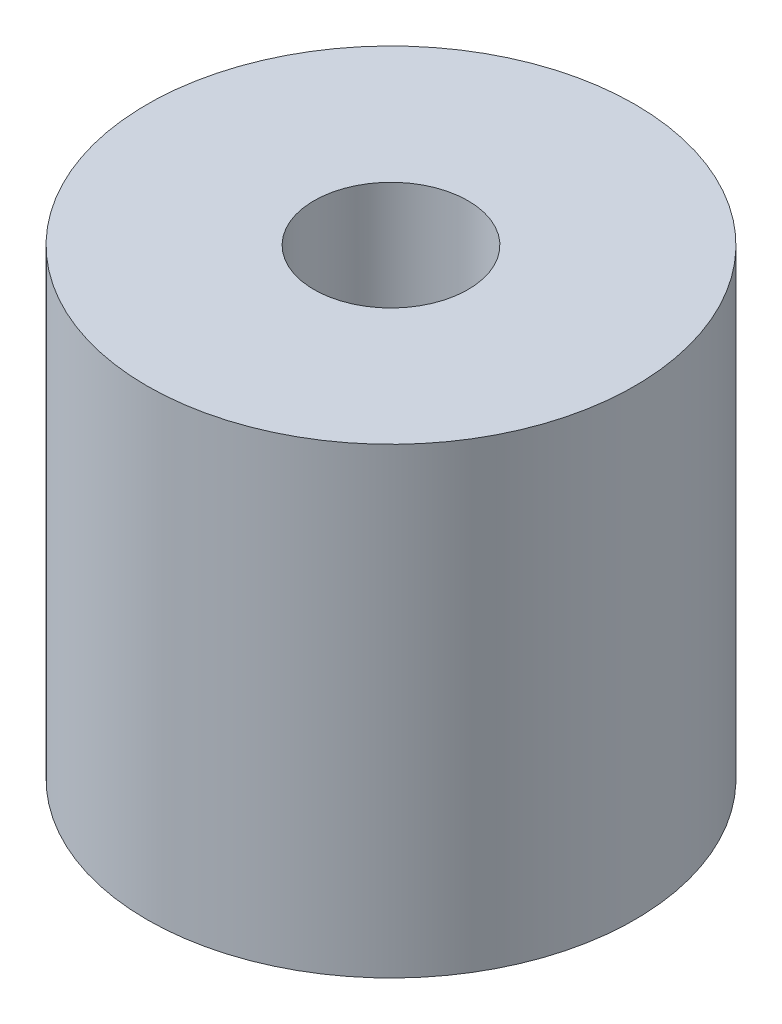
ISO-10303-21;
HEADER;
FILE_DESCRIPTION(('STEP AP214'),'2;1');
FILE_NAME('part.step','',(''),(''),'','','');
FILE_SCHEMA(('AUTOMOTIVE_DESIGN { 1 0 10303 214 1 1 1 1 }'));
ENDSEC;
DATA;
#1=APPLICATION_CONTEXT('core data for automotive mechanical design processes');
#2=APPLICATION_PROTOCOL_DEFINITION('international standard','automotive_design',2000,#1);
#3=PRODUCT_CONTEXT('',#1,'mechanical');
#4=PRODUCT('Part','Part','',(#3));
#5=PRODUCT_RELATED_PRODUCT_CATEGORY('part','',(#4));
#6=PRODUCT_DEFINITION_FORMATION('','',#4);
#7=PRODUCT_DEFINITION_CONTEXT('part definition',#1,'design');
#8=PRODUCT_DEFINITION('design','',#6,#7);
#9=PRODUCT_DEFINITION_SHAPE('','',#8);
#10=(LENGTH_UNIT() NAMED_UNIT(*) SI_UNIT(.MILLI.,.METRE.));
#11=(NAMED_UNIT(*) PLANE_ANGLE_UNIT() SI_UNIT($,.RADIAN.));
#12=(NAMED_UNIT(*) SI_UNIT($,.STERADIAN.) SOLID_ANGLE_UNIT());
#13=UNCERTAINTY_MEASURE_WITH_UNIT(LENGTH_MEASURE(1.E-05),#10,'distance_accuracy_value','');
#14=(GEOMETRIC_REPRESENTATION_CONTEXT(3) GLOBAL_UNCERTAINTY_ASSIGNED_CONTEXT((#13)) GLOBAL_UNIT_ASSIGNED_CONTEXT((#10,
#11,#12)) REPRESENTATION_CONTEXT('',''));
#15=CARTESIAN_POINT('',(0.,0.,0.));
#16=DIRECTION('',(0.,0.,1.));
#17=DIRECTION('',(1.,0.,0.));
#18=AXIS2_PLACEMENT_3D('',#15,#16,#17);
#19=CARTESIAN_POINT('',(0.,18.,0.));
#20=DIRECTION('',(0.,-1.,0.));
#21=DIRECTION('',(0.,0.,-1.));
#22=AXIS2_PLACEMENT_3D('',#19,#20,#21);
#23=CYLINDRICAL_SURFACE('',#22,9.5);
#24=CARTESIAN_POINT('',(0.,18.,0.));
#25=DIRECTION('',(0.,1.,0.));
#26=DIRECTION('',(0.,0.,1.));
#27=AXIS2_PLACEMENT_3D('',#24,#25,#26);
#28=CIRCLE('',#27,9.5);
#29=CARTESIAN_POINT('',(0.,18.,9.5));
#30=VERTEX_POINT('',#29);
#31=EDGE_CURVE('E10',#30,#30,#28,.T.);
#32=ORIENTED_EDGE('',*,*,#31,.F.);
#33=EDGE_LOOP('',(#32));
#34=FACE_BOUND('',#33,.T.);
#35=CARTESIAN_POINT('',(0.,0.,0.));
#36=DIRECTION('',(0.,1.,0.));
#37=DIRECTION('',(0.,0.,1.));
#38=AXIS2_PLACEMENT_3D('',#35,#36,#37);
#39=CIRCLE('',#38,9.5);
#40=CARTESIAN_POINT('',(0.,0.,9.5));
#41=VERTEX_POINT('',#40);
#42=EDGE_CURVE('E38',#41,#41,#39,.T.);
#43=ORIENTED_EDGE('',*,*,#42,.T.);
#44=EDGE_LOOP('',(#43));
#45=FACE_BOUND('',#44,.T.);
#46=ADVANCED_FACE('F31',(#34,#45),#23,.T.);
#47=CARTESIAN_POINT('',(0.,18.,0.));
#48=DIRECTION('',(0.,1.,0.));
#49=DIRECTION('',(0.,0.,1.));
#50=AXIS2_PLACEMENT_3D('',#47,#48,#49);
#51=PLANE('',#50);
#52=CARTESIAN_POINT('',(0.,18.,0.));
#53=DIRECTION('',(0.,-1.,0.));
#54=DIRECTION('',(0.,0.,-1.));
#55=AXIS2_PLACEMENT_3D('',#52,#53,#54);
#56=CIRCLE('',#55,3.);
#57=CARTESIAN_POINT('',(0.,18.,-3.));
#58=VERTEX_POINT('',#57);
#59=EDGE_CURVE('E44',#58,#58,#56,.T.);
#60=ORIENTED_EDGE('',*,*,#59,.T.);
#61=EDGE_LOOP('',(#60));
#62=FACE_BOUND('',#61,.T.);
#63=ORIENTED_EDGE('',*,*,#31,.T.);
#64=EDGE_LOOP('',(#63));
#65=FACE_BOUND('',#64,.T.);
#66=ADVANCED_FACE('F61',(#62,#65),#51,.T.);
#67=CARTESIAN_POINT('',(0.,0.,0.));
#68=DIRECTION('',(0.,1.,0.));
#69=DIRECTION('',(0.,0.,1.));
#70=AXIS2_PLACEMENT_3D('',#67,#68,#69);
#71=PLANE('',#70);
#72=CARTESIAN_POINT('',(0.,0.,0.));
#73=DIRECTION('',(0.,1.,0.));
#74=DIRECTION('',(0.,0.,1.));
#75=AXIS2_PLACEMENT_3D('',#72,#73,#74);
#76=CIRCLE('',#75,3.);
#77=CARTESIAN_POINT('',(0.,0.,3.));
#78=VERTEX_POINT('',#77);
#79=EDGE_CURVE('E34',#78,#78,#76,.T.);
#80=ORIENTED_EDGE('',*,*,#79,.T.);
#81=EDGE_LOOP('',(#80));
#82=FACE_BOUND('',#81,.T.);
#83=ORIENTED_EDGE('',*,*,#42,.F.);
#84=EDGE_LOOP('',(#83));
#85=FACE_BOUND('',#84,.T.);
#86=ADVANCED_FACE('F51',(#82,#85),#71,.F.);
#87=CARTESIAN_POINT('',(0.,18.,0.));
#88=DIRECTION('',(0.,-1.,0.));
#89=DIRECTION('',(0.,0.,-1.));
#90=AXIS2_PLACEMENT_3D('',#87,#88,#89);
#91=CYLINDRICAL_SURFACE('',#90,3.);
#92=ORIENTED_EDGE('',*,*,#59,.F.);
#93=EDGE_LOOP('',(#92));
#94=FACE_BOUND('',#93,.T.);
#95=ORIENTED_EDGE('',*,*,#79,.F.);
#96=EDGE_LOOP('',(#95));
#97=FACE_BOUND('',#96,.T.);
#98=ADVANCED_FACE('F54',(#94,#97),#91,.F.);
#99=CLOSED_SHELL('',(#46,#66,#86,#98));
#100=MANIFOLD_SOLID_BREP('B2',#99);
#101=ADVANCED_BREP_SHAPE_REPRESENTATION('',(#18,#100),#14);
#102=SHAPE_DEFINITION_REPRESENTATION(#9,#101);
ENDSEC;
END-ISO-10303-21;
